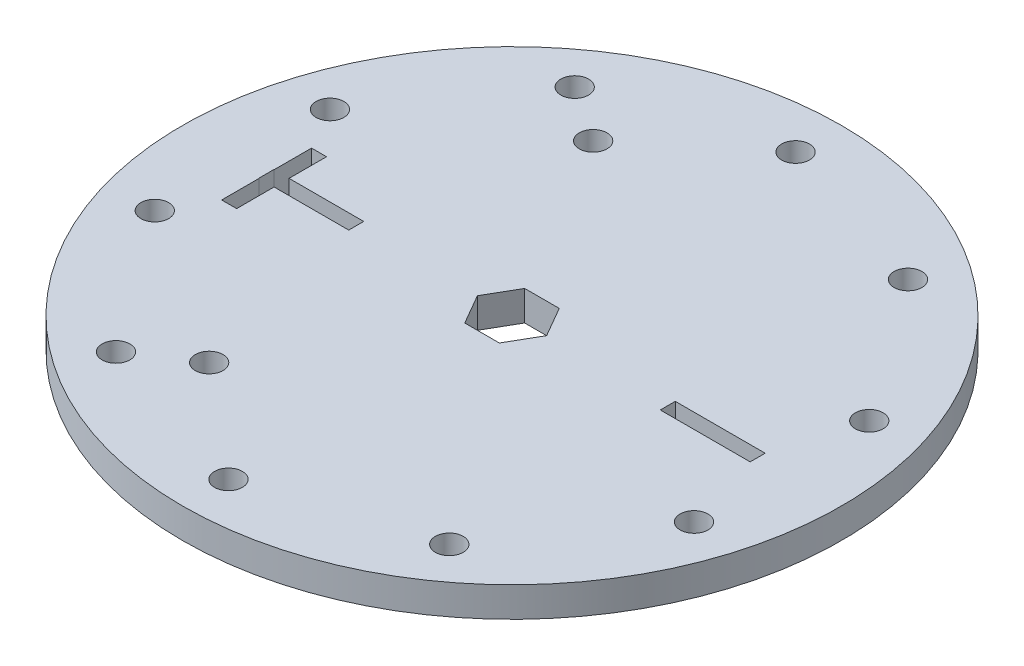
ISO-10303-21;
HEADER;
FILE_DESCRIPTION(('STEP AP214'),'2;1');
FILE_NAME('part.step','',(''),(''),'','','');
FILE_SCHEMA(('AUTOMOTIVE_DESIGN { 1 0 10303 214 1 1 1 1 }'));
ENDSEC;
DATA;
#1=APPLICATION_CONTEXT('core data for automotive mechanical design processes');
#2=APPLICATION_PROTOCOL_DEFINITION('international standard','automotive_design',2000,#1);
#3=PRODUCT_CONTEXT('',#1,'mechanical');
#4=PRODUCT('Part','Part','',(#3));
#5=PRODUCT_RELATED_PRODUCT_CATEGORY('part','',(#4));
#6=PRODUCT_DEFINITION_FORMATION('','',#4);
#7=PRODUCT_DEFINITION_CONTEXT('part definition',#1,'design');
#8=PRODUCT_DEFINITION('design','',#6,#7);
#9=PRODUCT_DEFINITION_SHAPE('','',#8);
#10=(LENGTH_UNIT() NAMED_UNIT(*) SI_UNIT(.MILLI.,.METRE.));
#11=(NAMED_UNIT(*) PLANE_ANGLE_UNIT() SI_UNIT($,.RADIAN.));
#12=(NAMED_UNIT(*) SI_UNIT($,.STERADIAN.) SOLID_ANGLE_UNIT());
#13=UNCERTAINTY_MEASURE_WITH_UNIT(LENGTH_MEASURE(1.E-05),#10,'distance_accuracy_value','');
#14=(GEOMETRIC_REPRESENTATION_CONTEXT(3) GLOBAL_UNCERTAINTY_ASSIGNED_CONTEXT((#13)) GLOBAL_UNIT_ASSIGNED_CONTEXT((#10,
#11,#12)) REPRESENTATION_CONTEXT('',''));
#15=CARTESIAN_POINT('',(0.,0.,0.));
#16=DIRECTION('',(0.,0.,1.));
#17=DIRECTION('',(1.,0.,0.));
#18=AXIS2_PLACEMENT_3D('',#15,#16,#17);
#19=CARTESIAN_POINT('',(-26.035,0.,-0.79375));
#20=DIRECTION('',(0.,0.,-1.));
#21=DIRECTION('',(-1.,0.,0.));
#22=AXIS2_PLACEMENT_3D('',#19,#20,#21);
#23=PLANE('',#22);
#24=DIRECTION('',(-1.,0.,0.));
#25=VECTOR('',#24,1.);
#26=CARTESIAN_POINT('',(-26.035,0.,-0.79375));
#27=LINE('',#26,#25);
#28=CARTESIAN_POINT('',(-26.0055980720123,0.,-0.79375));
#29=VERTEX_POINT('',#28);
#30=CARTESIAN_POINT('',(-26.035,0.,-0.79375));
#31=VERTEX_POINT('',#30);
#32=EDGE_CURVE('E276',#29,#31,#27,.T.);
#33=ORIENTED_EDGE('',*,*,#32,.F.);
#34=DIRECTION('',(0.,1.,0.));
#35=VECTOR('',#34,1.);
#36=CARTESIAN_POINT('',(-26.0055980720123,0.,-0.79375));
#37=LINE('',#36,#35);
#38=CARTESIAN_POINT('',(-26.0055980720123,3.175,-0.79375));
#39=VERTEX_POINT('',#38);
#40=EDGE_CURVE('E232',#29,#39,#37,.T.);
#41=ORIENTED_EDGE('',*,*,#40,.T.);
#42=DIRECTION('',(-1.,0.,0.));
#43=VECTOR('',#42,1.);
#44=CARTESIAN_POINT('',(-26.035,3.175,-0.79375));
#45=LINE('',#44,#43);
#46=CARTESIAN_POINT('',(-26.035,3.175,-0.79375));
#47=VERTEX_POINT('',#46);
#48=EDGE_CURVE('E289',#39,#47,#45,.T.);
#49=ORIENTED_EDGE('',*,*,#48,.T.);
#50=DIRECTION('',(0.,1.,0.));
#51=VECTOR('',#50,1.);
#52=CARTESIAN_POINT('',(-26.035,0.,-0.79375));
#53=LINE('',#52,#51);
#54=EDGE_CURVE('E292',#31,#47,#53,.T.);
#55=ORIENTED_EDGE('',*,*,#54,.F.);
#56=EDGE_LOOP('',(#33,#41,#49,#55));
#57=FACE_BOUND('',#56,.T.);
#58=ADVANCED_FACE('F33',(#57),#23,.F.);
#59=CARTESIAN_POINT('',(-26.035,0.,0.793750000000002));
#60=DIRECTION('',(0.,0.,1.));
#61=DIRECTION('',(1.,0.,0.));
#62=AXIS2_PLACEMENT_3D('',#59,#60,#61);
#63=PLANE('',#62);
#64=DIRECTION('',(1.,0.,0.));
#65=VECTOR('',#64,1.);
#66=CARTESIAN_POINT('',(-26.035,3.175,0.793750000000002));
#67=LINE('',#66,#65);
#68=CARTESIAN_POINT('',(-26.035,3.175,0.793750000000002));
#69=VERTEX_POINT('',#68);
#70=CARTESIAN_POINT('',(-26.0055980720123,3.175,0.793750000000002));
#71=VERTEX_POINT('',#70);
#72=EDGE_CURVE('E283',#69,#71,#67,.T.);
#73=ORIENTED_EDGE('',*,*,#72,.T.);
#74=DIRECTION('',(0.,-1.,0.));
#75=VECTOR('',#74,1.);
#76=CARTESIAN_POINT('',(-26.0055980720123,0.,0.793750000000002));
#77=LINE('',#76,#75);
#78=CARTESIAN_POINT('',(-26.0055980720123,0.,0.793750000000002));
#79=VERTEX_POINT('',#78);
#80=EDGE_CURVE('E11',#71,#79,#77,.T.);
#81=ORIENTED_EDGE('',*,*,#80,.T.);
#82=DIRECTION('',(1.,0.,0.));
#83=VECTOR('',#82,1.);
#84=CARTESIAN_POINT('',(-26.035,0.,0.793750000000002));
#85=LINE('',#84,#83);
#86=CARTESIAN_POINT('',(-26.035,0.,0.793750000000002));
#87=VERTEX_POINT('',#86);
#88=EDGE_CURVE('E208',#87,#79,#85,.T.);
#89=ORIENTED_EDGE('',*,*,#88,.F.);
#90=DIRECTION('',(0.,1.,0.));
#91=VECTOR('',#90,1.);
#92=CARTESIAN_POINT('',(-26.035,0.,0.793750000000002));
#93=LINE('',#92,#91);
#94=EDGE_CURVE('E280',#87,#69,#93,.T.);
#95=ORIENTED_EDGE('',*,*,#94,.T.);
#96=EDGE_LOOP('',(#73,#81,#89,#95));
#97=FACE_BOUND('',#96,.T.);
#98=ADVANCED_FACE('F444',(#97),#63,.F.);
#99=CARTESIAN_POINT('',(0.,3.175,0.));
#100=DIRECTION('',(0.,1.,0.));
#101=DIRECTION('',(0.,0.,1.));
#102=AXIS2_PLACEMENT_3D('',#99,#100,#101);
#103=PLANE('',#102);
#104=DIRECTION('',(0.,0.,1.));
#105=VECTOR('',#104,1.);
#106=CARTESIAN_POINT('',(-26.0055980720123,3.175,-4.7625));
#107=LINE('',#106,#105);
#108=CARTESIAN_POINT('',(-26.0055980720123,3.175,-4.7625));
#109=VERTEX_POINT('',#108);
#110=EDGE_CURVE('E218',#109,#39,#107,.T.);
#111=ORIENTED_EDGE('',*,*,#110,.F.);
#112=DIRECTION('',(-1.,0.,0.));
#113=VECTOR('',#112,1.);
#114=CARTESIAN_POINT('',(-26.0055980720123,3.175,-4.7625));
#115=LINE('',#114,#113);
#116=CARTESIAN_POINT('',(-24.4180980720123,3.175,-4.7625));
#117=VERTEX_POINT('',#116);
#118=EDGE_CURVE('E209',#117,#109,#115,.T.);
#119=ORIENTED_EDGE('',*,*,#118,.F.);
#120=DIRECTION('',(0.,0.,-1.));
#121=VECTOR('',#120,1.);
#122=CARTESIAN_POINT('',(-24.4180980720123,3.175,-4.7625));
#123=LINE('',#122,#121);
#124=CARTESIAN_POINT('',(-24.4180980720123,3.175,-0.79375));
#125=VERTEX_POINT('',#124);
#126=EDGE_CURVE('E222',#125,#117,#123,.T.);
#127=ORIENTED_EDGE('',*,*,#126,.F.);
#128=CARTESIAN_POINT('',(-16.51,3.175,-0.79375));
#129=VERTEX_POINT('',#128);
#130=EDGE_CURVE('E271',#129,#125,#45,.T.);
#131=ORIENTED_EDGE('',*,*,#130,.F.);
#132=DIRECTION('',(0.,0.,-1.));
#133=VECTOR('',#132,1.);
#134=CARTESIAN_POINT('',(-16.51,3.175,-0.79375));
#135=LINE('',#134,#133);
#136=CARTESIAN_POINT('',(-16.51,3.175,0.79375));
#137=VERTEX_POINT('',#136);
#138=EDGE_CURVE('E286',#137,#129,#135,.T.);
#139=ORIENTED_EDGE('',*,*,#138,.F.);
#140=CARTESIAN_POINT('',(-24.4180980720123,3.175,0.793750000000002));
#141=VERTEX_POINT('',#140);
#142=EDGE_CURVE('E282',#141,#137,#67,.T.);
#143=ORIENTED_EDGE('',*,*,#142,.F.);
#144=CARTESIAN_POINT('',(-24.4180980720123,3.175,4.7625));
#145=VERTEX_POINT('',#144);
#146=EDGE_CURVE('E56',#145,#141,#123,.T.);
#147=ORIENTED_EDGE('',*,*,#146,.F.);
#148=DIRECTION('',(1.,0.,0.));
#149=VECTOR('',#148,1.);
#150=CARTESIAN_POINT('',(-26.0055980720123,3.175,4.7625));
#151=LINE('',#150,#149);
#152=CARTESIAN_POINT('',(-26.0055980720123,3.175,4.7625));
#153=VERTEX_POINT('',#152);
#154=EDGE_CURVE('E220',#153,#145,#151,.T.);
#155=ORIENTED_EDGE('',*,*,#154,.F.);
#156=EDGE_CURVE('E187',#71,#153,#107,.T.);
#157=ORIENTED_EDGE('',*,*,#156,.F.);
#158=ORIENTED_EDGE('',*,*,#72,.F.);
#159=DIRECTION('',(0.,0.,1.));
#160=VECTOR('',#159,1.);
#161=CARTESIAN_POINT('',(-26.035,3.175,-0.79375));
#162=LINE('',#161,#160);
#163=EDGE_CURVE('E261',#47,#69,#162,.T.);
#164=ORIENTED_EDGE('',*,*,#163,.F.);
#165=ORIENTED_EDGE('',*,*,#48,.F.);
#166=EDGE_LOOP('',(#111,#119,#127,#131,#139,#143,#147,#155,#157,#158,#164,#165));
#167=FACE_BOUND('',#166,.T.);
#168=DIRECTION('',(-1.,0.,0.));
#169=VECTOR('',#168,1.);
#170=CARTESIAN_POINT('',(26.035,3.175,-0.793749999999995));
#171=LINE('',#170,#169);
#172=CARTESIAN_POINT('',(26.035,3.175,-0.793749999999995));
#173=VERTEX_POINT('',#172);
#174=CARTESIAN_POINT('',(16.51,3.175,-0.793749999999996));
#175=VERTEX_POINT('',#174);
#176=EDGE_CURVE('E235',#173,#175,#171,.T.);
#177=ORIENTED_EDGE('',*,*,#176,.F.);
#178=DIRECTION('',(0.,0.,-1.));
#179=VECTOR('',#178,1.);
#180=CARTESIAN_POINT('',(26.035,3.175,-0.793749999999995));
#181=LINE('',#180,#179);
#182=CARTESIAN_POINT('',(26.035,3.175,0.793749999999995));
#183=VERTEX_POINT('',#182);
#184=EDGE_CURVE('E240',#183,#173,#181,.T.);
#185=ORIENTED_EDGE('',*,*,#184,.F.);
#186=DIRECTION('',(1.,0.,0.));
#187=VECTOR('',#186,1.);
#188=CARTESIAN_POINT('',(26.035,3.175,0.793749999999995));
#189=LINE('',#188,#187);
#190=CARTESIAN_POINT('',(16.51,3.175,0.793749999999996));
#191=VERTEX_POINT('',#190);
#192=EDGE_CURVE('E254',#191,#183,#189,.T.);
#193=ORIENTED_EDGE('',*,*,#192,.F.);
#194=DIRECTION('',(0.,0.,1.));
#195=VECTOR('',#194,1.);
#196=CARTESIAN_POINT('',(16.51,3.175,-0.793749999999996));
#197=LINE('',#196,#195);
#198=EDGE_CURVE('E251',#175,#191,#197,.T.);
#199=ORIENTED_EDGE('',*,*,#198,.F.);
#200=EDGE_LOOP('',(#177,#185,#193,#199));
#201=FACE_BOUND('',#200,.T.);
#202=CARTESIAN_POINT('',(-11.7475,3.175,-20.3472668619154));
#203=DIRECTION('',(0.,1.,0.));
#204=DIRECTION('',(0.,0.,1.));
#205=AXIS2_PLACEMENT_3D('',#202,#203,#204);
#206=CIRCLE('',#205,1.47319999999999);
#207=CARTESIAN_POINT('',(-11.7475,3.175,-18.8740668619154));
#208=VERTEX_POINT('',#207);
#209=EDGE_CURVE('E295',#208,#208,#206,.T.);
#210=ORIENTED_EDGE('',*,*,#209,.F.);
#211=EDGE_LOOP('',(#210));
#212=FACE_BOUND('',#211,.T.);
#213=CARTESIAN_POINT('',(-11.7474999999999,3.175,20.3472668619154));
#214=DIRECTION('',(0.,1.,0.));
#215=DIRECTION('',(0.,0.,1.));
#216=AXIS2_PLACEMENT_3D('',#213,#214,#215);
#217=CIRCLE('',#216,1.47319999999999);
#218=CARTESIAN_POINT('',(-11.7474999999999,3.175,21.8204668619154));
#219=VERTEX_POINT('',#218);
#220=EDGE_CURVE('E308',#219,#219,#217,.T.);
#221=ORIENTED_EDGE('',*,*,#220,.F.);
#222=EDGE_LOOP('',(#221));
#223=FACE_BOUND('',#222,.T.);
#224=CARTESIAN_POINT('',(0.,3.175,-30.0455330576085));
#225=DIRECTION('',(0.,1.,0.));
#226=DIRECTION('',(0.,0.,1.));
#227=AXIS2_PLACEMENT_3D('',#224,#225,#226);
#228=CIRCLE('',#227,1.4732);
#229=CARTESIAN_POINT('',(0.,3.175,-28.5723330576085));
#230=VERTEX_POINT('',#229);
#231=EDGE_CURVE('E314',#230,#230,#228,.T.);
#232=ORIENTED_EDGE('',*,*,#231,.F.);
#233=EDGE_LOOP('',(#232));
#234=FACE_BOUND('',#233,.T.);
#235=CARTESIAN_POINT('',(-17.6603212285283,3.175,-24.3073468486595));
#236=DIRECTION('',(0.,1.,0.));
#237=DIRECTION('',(0.,0.,1.));
#238=AXIS2_PLACEMENT_3D('',#235,#236,#237);
#239=CIRCLE('',#238,1.4732);
#240=CARTESIAN_POINT('',(-17.6603212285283,3.175,-22.8341468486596));
#241=VERTEX_POINT('',#240);
#242=EDGE_CURVE('E320',#241,#241,#239,.T.);
#243=ORIENTED_EDGE('',*,*,#242,.F.);
#244=EDGE_LOOP('',(#243));
#245=FACE_BOUND('',#244,.T.);
#246=CARTESIAN_POINT('',(-28.575,3.175,-9.2845803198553));
#247=DIRECTION('',(0.,1.,0.));
#248=DIRECTION('',(0.,0.,1.));
#249=AXIS2_PLACEMENT_3D('',#246,#247,#248);
#250=CIRCLE('',#249,1.4732);
#251=CARTESIAN_POINT('',(-28.575,3.175,-7.8113803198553));
#252=VERTEX_POINT('',#251);
#253=EDGE_CURVE('E326',#252,#252,#250,.T.);
#254=ORIENTED_EDGE('',*,*,#253,.F.);
#255=EDGE_LOOP('',(#254));
#256=FACE_BOUND('',#255,.T.);
#257=CARTESIAN_POINT('',(-28.575,3.175,9.28458031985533));
#258=DIRECTION('',(0.,1.,0.));
#259=DIRECTION('',(0.,0.,1.));
#260=AXIS2_PLACEMENT_3D('',#257,#258,#259);
#261=CIRCLE('',#260,1.4732);
#262=CARTESIAN_POINT('',(-28.575,3.175,10.7577803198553));
#263=VERTEX_POINT('',#262);
#264=EDGE_CURVE('E332',#263,#263,#261,.T.);
#265=ORIENTED_EDGE('',*,*,#264,.F.);
#266=EDGE_LOOP('',(#265));
#267=FACE_BOUND('',#266,.T.);
#268=CARTESIAN_POINT('',(-17.6603212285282,3.175,24.3073468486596));
#269=DIRECTION('',(0.,1.,0.));
#270=DIRECTION('',(0.,0.,1.));
#271=AXIS2_PLACEMENT_3D('',#268,#269,#270);
#272=CIRCLE('',#271,1.4732);
#273=CARTESIAN_POINT('',(-17.6603212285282,3.175,25.7805468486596));
#274=VERTEX_POINT('',#273);
#275=EDGE_CURVE('E338',#274,#274,#272,.T.);
#276=ORIENTED_EDGE('',*,*,#275,.F.);
#277=EDGE_LOOP('',(#276));
#278=FACE_BOUND('',#277,.T.);
#279=CARTESIAN_POINT('',(0.,3.175,30.0455330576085));
#280=DIRECTION('',(0.,1.,0.));
#281=DIRECTION('',(0.,0.,1.));
#282=AXIS2_PLACEMENT_3D('',#279,#280,#281);
#283=CIRCLE('',#282,1.4732);
#284=CARTESIAN_POINT('',(0.,3.175,31.5187330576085));
#285=VERTEX_POINT('',#284);
#286=EDGE_CURVE('E344',#285,#285,#283,.T.);
#287=ORIENTED_EDGE('',*,*,#286,.F.);
#288=EDGE_LOOP('',(#287));
#289=FACE_BOUND('',#288,.T.);
#290=CARTESIAN_POINT('',(17.6603212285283,3.175,24.3073468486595));
#291=DIRECTION('',(0.,1.,0.));
#292=DIRECTION('',(0.,0.,1.));
#293=AXIS2_PLACEMENT_3D('',#290,#291,#292);
#294=CIRCLE('',#293,1.4732);
#295=CARTESIAN_POINT('',(17.6603212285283,3.175,25.7805468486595));
#296=VERTEX_POINT('',#295);
#297=EDGE_CURVE('E350',#296,#296,#294,.T.);
#298=ORIENTED_EDGE('',*,*,#297,.F.);
#299=EDGE_LOOP('',(#298));
#300=FACE_BOUND('',#299,.T.);
#301=CARTESIAN_POINT('',(28.575,3.175,9.28458031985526));
#302=DIRECTION('',(0.,1.,0.));
#303=DIRECTION('',(0.,0.,1.));
#304=AXIS2_PLACEMENT_3D('',#301,#302,#303);
#305=CIRCLE('',#304,1.4732);
#306=CARTESIAN_POINT('',(28.575,3.175,10.7577803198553));
#307=VERTEX_POINT('',#306);
#308=EDGE_CURVE('E356',#307,#307,#305,.T.);
#309=ORIENTED_EDGE('',*,*,#308,.F.);
#310=EDGE_LOOP('',(#309));
#311=FACE_BOUND('',#310,.T.);
#312=CARTESIAN_POINT('',(28.575,3.175,-9.28458031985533));
#313=DIRECTION('',(0.,1.,0.));
#314=DIRECTION('',(0.,0.,1.));
#315=AXIS2_PLACEMENT_3D('',#312,#313,#314);
#316=CIRCLE('',#315,1.4732);
#317=CARTESIAN_POINT('',(28.575,3.175,-7.81138031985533));
#318=VERTEX_POINT('',#317);
#319=EDGE_CURVE('E362',#318,#318,#316,.T.);
#320=ORIENTED_EDGE('',*,*,#319,.F.);
#321=EDGE_LOOP('',(#320));
#322=FACE_BOUND('',#321,.T.);
#323=CARTESIAN_POINT('',(17.6603212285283,3.175,-24.3073468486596));
#324=DIRECTION('',(0.,1.,0.));
#325=DIRECTION('',(0.,0.,1.));
#326=AXIS2_PLACEMENT_3D('',#323,#324,#325);
#327=CIRCLE('',#326,1.4732);
#328=CARTESIAN_POINT('',(17.6603212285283,3.175,-22.8341468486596));
#329=VERTEX_POINT('',#328);
#330=EDGE_CURVE('E368',#329,#329,#327,.T.);
#331=ORIENTED_EDGE('',*,*,#330,.F.);
#332=EDGE_LOOP('',(#331));
#333=FACE_BOUND('',#332,.T.);
#334=CARTESIAN_POINT('',(0.,3.175,0.));
#335=DIRECTION('',(0.,1.,0.));
#336=DIRECTION('',(0.,0.,1.));
#337=AXIS2_PLACEMENT_3D('',#334,#335,#336);
#338=CIRCLE('',#337,34.925);
#339=CARTESIAN_POINT('',(0.,3.175,34.925));
#340=VERTEX_POINT('',#339);
#341=EDGE_CURVE('E420',#340,#340,#338,.T.);
#342=ORIENTED_EDGE('',*,*,#341,.T.);
#343=EDGE_LOOP('',(#342));
#344=FACE_BOUND('',#343,.T.);
#345=DIRECTION('',(-1.,0.,0.));
#346=VECTOR('',#345,1.);
#347=CARTESIAN_POINT('',(1.83308710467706,3.175,-3.175));
#348=LINE('',#347,#346);
#349=CARTESIAN_POINT('',(1.83308710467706,3.175,-3.175));
#350=VERTEX_POINT('',#349);
#351=CARTESIAN_POINT('',(-1.83308710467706,3.175,-3.175));
#352=VERTEX_POINT('',#351);
#353=EDGE_CURVE('E377',#350,#352,#348,.T.);
#354=ORIENTED_EDGE('',*,*,#353,.F.);
#355=DIRECTION('',(-0.5,0.,-0.866025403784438));
#356=VECTOR('',#355,1.);
#357=CARTESIAN_POINT('',(3.66617420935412,3.175,0.));
#358=LINE('',#357,#356);
#359=CARTESIAN_POINT('',(3.66617420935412,3.175,0.));
#360=VERTEX_POINT('',#359);
#361=EDGE_CURVE('E375',#360,#350,#358,.T.);
#362=ORIENTED_EDGE('',*,*,#361,.F.);
#363=DIRECTION('',(0.5,0.,-0.866025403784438));
#364=VECTOR('',#363,1.);
#365=CARTESIAN_POINT('',(1.83308710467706,3.175,3.175));
#366=LINE('',#365,#364);
#367=CARTESIAN_POINT('',(1.83308710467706,3.175,3.175));
#368=VERTEX_POINT('',#367);
#369=EDGE_CURVE('E387',#368,#360,#366,.T.);
#370=ORIENTED_EDGE('',*,*,#369,.F.);
#371=DIRECTION('',(1.,0.,0.));
#372=VECTOR('',#371,1.);
#373=CARTESIAN_POINT('',(-1.83308710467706,3.175,3.175));
#374=LINE('',#373,#372);
#375=CARTESIAN_POINT('',(-1.83308710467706,3.175,3.175));
#376=VERTEX_POINT('',#375);
#377=EDGE_CURVE('E384',#376,#368,#374,.T.);
#378=ORIENTED_EDGE('',*,*,#377,.F.);
#379=DIRECTION('',(0.5,0.,0.866025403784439));
#380=VECTOR('',#379,1.);
#381=CARTESIAN_POINT('',(-3.66617420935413,3.175,0.));
#382=LINE('',#381,#380);
#383=CARTESIAN_POINT('',(-3.66617420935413,3.175,0.));
#384=VERTEX_POINT('',#383);
#385=EDGE_CURVE('E382',#384,#376,#382,.T.);
#386=ORIENTED_EDGE('',*,*,#385,.F.);
#387=DIRECTION('',(-0.5,0.,0.866025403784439));
#388=VECTOR('',#387,1.);
#389=CARTESIAN_POINT('',(-1.83308710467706,3.175,-3.175));
#390=LINE('',#389,#388);
#391=EDGE_CURVE('E380',#352,#384,#390,.T.);
#392=ORIENTED_EDGE('',*,*,#391,.F.);
#393=EDGE_LOOP('',(#354,#362,#370,#378,#386,#392));
#394=FACE_BOUND('',#393,.T.);
#395=ADVANCED_FACE('F432',(#167,#201,#212,#223,#234,#245,#256,#267,#278,#289,#300,#311,#322,
#333,#344,#394),#103,.T.);
#396=CARTESIAN_POINT('',(0.,0.,0.));
#397=DIRECTION('',(0.,1.,0.));
#398=DIRECTION('',(0.,0.,1.));
#399=AXIS2_PLACEMENT_3D('',#396,#397,#398);
#400=PLANE('',#399);
#401=DIRECTION('',(-1.,0.,0.));
#402=VECTOR('',#401,1.);
#403=CARTESIAN_POINT('',(-26.0055980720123,0.,-4.7625));
#404=LINE('',#403,#402);
#405=CARTESIAN_POINT('',(-24.4180980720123,0.,-4.7625));
#406=VERTEX_POINT('',#405);
#407=CARTESIAN_POINT('',(-26.0055980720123,0.,-4.7625));
#408=VERTEX_POINT('',#407);
#409=EDGE_CURVE('E192',#406,#408,#404,.T.);
#410=ORIENTED_EDGE('',*,*,#409,.T.);
#411=DIRECTION('',(0.,0.,1.));
#412=VECTOR('',#411,1.);
#413=CARTESIAN_POINT('',(-26.0055980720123,0.,-4.7625));
#414=LINE('',#413,#412);
#415=EDGE_CURVE('E200',#408,#29,#414,.T.);
#416=ORIENTED_EDGE('',*,*,#415,.T.);
#417=ORIENTED_EDGE('',*,*,#32,.T.);
#418=DIRECTION('',(0.,0.,1.));
#419=VECTOR('',#418,1.);
#420=CARTESIAN_POINT('',(-26.035,0.,-0.79375));
#421=LINE('',#420,#419);
#422=EDGE_CURVE('E268',#31,#87,#421,.T.);
#423=ORIENTED_EDGE('',*,*,#422,.T.);
#424=ORIENTED_EDGE('',*,*,#88,.T.);
#425=CARTESIAN_POINT('',(-26.0055980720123,0.,4.7625));
#426=VERTEX_POINT('',#425);
#427=EDGE_CURVE('E185',#79,#426,#414,.T.);
#428=ORIENTED_EDGE('',*,*,#427,.T.);
#429=DIRECTION('',(1.,0.,0.));
#430=VECTOR('',#429,1.);
#431=CARTESIAN_POINT('',(-26.0055980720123,0.,4.7625));
#432=LINE('',#431,#430);
#433=CARTESIAN_POINT('',(-24.4180980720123,0.,4.7625));
#434=VERTEX_POINT('',#433);
#435=EDGE_CURVE('E195',#426,#434,#432,.T.);
#436=ORIENTED_EDGE('',*,*,#435,.T.);
#437=DIRECTION('',(0.,0.,-1.));
#438=VECTOR('',#437,1.);
#439=CARTESIAN_POINT('',(-24.4180980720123,0.,-4.7625));
#440=LINE('',#439,#438);
#441=CARTESIAN_POINT('',(-24.4180980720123,0.,0.793750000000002));
#442=VERTEX_POINT('',#441);
#443=EDGE_CURVE('E215',#434,#442,#440,.T.);
#444=ORIENTED_EDGE('',*,*,#443,.T.);
#445=CARTESIAN_POINT('',(-16.51,0.,0.79375));
#446=VERTEX_POINT('',#445);
#447=EDGE_CURVE('E270',#442,#446,#85,.T.);
#448=ORIENTED_EDGE('',*,*,#447,.T.);
#449=DIRECTION('',(0.,0.,-1.));
#450=VECTOR('',#449,1.);
#451=CARTESIAN_POINT('',(-16.51,0.,-0.79375));
#452=LINE('',#451,#450);
#453=CARTESIAN_POINT('',(-16.51,0.,-0.79375));
#454=VERTEX_POINT('',#453);
#455=EDGE_CURVE('E273',#446,#454,#452,.T.);
#456=ORIENTED_EDGE('',*,*,#455,.T.);
#457=CARTESIAN_POINT('',(-24.4180980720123,0.,-0.79375));
#458=VERTEX_POINT('',#457);
#459=EDGE_CURVE('E277',#454,#458,#27,.T.);
#460=ORIENTED_EDGE('',*,*,#459,.T.);
#461=EDGE_CURVE('E48',#458,#406,#440,.T.);
#462=ORIENTED_EDGE('',*,*,#461,.T.);
#463=EDGE_LOOP('',(#410,#416,#417,#423,#424,#428,#436,#444,#448,#456,#460,#462));
#464=FACE_BOUND('',#463,.T.);
#465=DIRECTION('',(0.,0.,-1.));
#466=VECTOR('',#465,1.);
#467=CARTESIAN_POINT('',(26.035,0.,-0.793749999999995));
#468=LINE('',#467,#466);
#469=CARTESIAN_POINT('',(26.035,0.,0.793749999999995));
#470=VERTEX_POINT('',#469);
#471=CARTESIAN_POINT('',(26.035,0.,-0.793749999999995));
#472=VERTEX_POINT('',#471);
#473=EDGE_CURVE('E246',#470,#472,#468,.T.);
#474=ORIENTED_EDGE('',*,*,#473,.T.);
#475=DIRECTION('',(-1.,0.,0.));
#476=VECTOR('',#475,1.);
#477=CARTESIAN_POINT('',(26.035,0.,-0.793749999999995));
#478=LINE('',#477,#476);
#479=CARTESIAN_POINT('',(16.51,0.,-0.793749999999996));
#480=VERTEX_POINT('',#479);
#481=EDGE_CURVE('E236',#472,#480,#478,.T.);
#482=ORIENTED_EDGE('',*,*,#481,.T.);
#483=DIRECTION('',(0.,0.,1.));
#484=VECTOR('',#483,1.);
#485=CARTESIAN_POINT('',(16.51,0.,-0.793749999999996));
#486=LINE('',#485,#484);
#487=CARTESIAN_POINT('',(16.51,0.,0.793749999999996));
#488=VERTEX_POINT('',#487);
#489=EDGE_CURVE('E239',#480,#488,#486,.T.);
#490=ORIENTED_EDGE('',*,*,#489,.T.);
#491=DIRECTION('',(1.,0.,0.));
#492=VECTOR('',#491,1.);
#493=CARTESIAN_POINT('',(26.035,0.,0.793749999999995));
#494=LINE('',#493,#492);
#495=EDGE_CURVE('E243',#488,#470,#494,.T.);
#496=ORIENTED_EDGE('',*,*,#495,.T.);
#497=EDGE_LOOP('',(#474,#482,#490,#496));
#498=FACE_BOUND('',#497,.T.);
#499=CARTESIAN_POINT('',(-11.7475,0.,-20.3472668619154));
#500=DIRECTION('',(0.,1.,0.));
#501=DIRECTION('',(0.,0.,1.));
#502=AXIS2_PLACEMENT_3D('',#499,#500,#501);
#503=CIRCLE('',#502,1.4732);
#504=CARTESIAN_POINT('',(-11.7475,0.,-18.8740668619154));
#505=VERTEX_POINT('',#504);
#506=EDGE_CURVE('E305',#505,#505,#503,.T.);
#507=ORIENTED_EDGE('',*,*,#506,.T.);
#508=EDGE_LOOP('',(#507));
#509=FACE_BOUND('',#508,.T.);
#510=CARTESIAN_POINT('',(-11.7474999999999,0.,20.3472668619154));
#511=DIRECTION('',(0.,1.,0.));
#512=DIRECTION('',(0.,0.,1.));
#513=AXIS2_PLACEMENT_3D('',#510,#511,#512);
#514=CIRCLE('',#513,1.4732);
#515=CARTESIAN_POINT('',(-11.7474999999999,0.,21.8204668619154));
#516=VERTEX_POINT('',#515);
#517=EDGE_CURVE('E311',#516,#516,#514,.T.);
#518=ORIENTED_EDGE('',*,*,#517,.T.);
#519=EDGE_LOOP('',(#518));
#520=FACE_BOUND('',#519,.T.);
#521=CARTESIAN_POINT('',(0.,0.,-30.0455330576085));
#522=DIRECTION('',(0.,1.,0.));
#523=DIRECTION('',(0.,0.,1.));
#524=AXIS2_PLACEMENT_3D('',#521,#522,#523);
#525=CIRCLE('',#524,1.4732);
#526=CARTESIAN_POINT('',(0.,0.,-28.5723330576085));
#527=VERTEX_POINT('',#526);
#528=EDGE_CURVE('E317',#527,#527,#525,.T.);
#529=ORIENTED_EDGE('',*,*,#528,.T.);
#530=EDGE_LOOP('',(#529));
#531=FACE_BOUND('',#530,.T.);
#532=CARTESIAN_POINT('',(-17.6603212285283,0.,-24.3073468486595));
#533=DIRECTION('',(0.,1.,0.));
#534=DIRECTION('',(0.,0.,1.));
#535=AXIS2_PLACEMENT_3D('',#532,#533,#534);
#536=CIRCLE('',#535,1.4732);
#537=CARTESIAN_POINT('',(-17.6603212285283,0.,-22.8341468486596));
#538=VERTEX_POINT('',#537);
#539=EDGE_CURVE('E323',#538,#538,#536,.T.);
#540=ORIENTED_EDGE('',*,*,#539,.T.);
#541=EDGE_LOOP('',(#540));
#542=FACE_BOUND('',#541,.T.);
#543=CARTESIAN_POINT('',(-28.575,0.,-9.2845803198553));
#544=DIRECTION('',(0.,1.,0.));
#545=DIRECTION('',(0.,0.,1.));
#546=AXIS2_PLACEMENT_3D('',#543,#544,#545);
#547=CIRCLE('',#546,1.4732);
#548=CARTESIAN_POINT('',(-28.575,0.,-7.81138031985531));
#549=VERTEX_POINT('',#548);
#550=EDGE_CURVE('E329',#549,#549,#547,.T.);
#551=ORIENTED_EDGE('',*,*,#550,.T.);
#552=EDGE_LOOP('',(#551));
#553=FACE_BOUND('',#552,.T.);
#554=CARTESIAN_POINT('',(-28.575,0.,9.28458031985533));
#555=DIRECTION('',(0.,1.,0.));
#556=DIRECTION('',(0.,0.,1.));
#557=AXIS2_PLACEMENT_3D('',#554,#555,#556);
#558=CIRCLE('',#557,1.4732);
#559=CARTESIAN_POINT('',(-28.575,0.,10.7577803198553));
#560=VERTEX_POINT('',#559);
#561=EDGE_CURVE('E335',#560,#560,#558,.T.);
#562=ORIENTED_EDGE('',*,*,#561,.T.);
#563=EDGE_LOOP('',(#562));
#564=FACE_BOUND('',#563,.T.);
#565=CARTESIAN_POINT('',(-17.6603212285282,0.,24.3073468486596));
#566=DIRECTION('',(0.,1.,0.));
#567=DIRECTION('',(0.,0.,1.));
#568=AXIS2_PLACEMENT_3D('',#565,#566,#567);
#569=CIRCLE('',#568,1.4732);
#570=CARTESIAN_POINT('',(-17.6603212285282,0.,25.7805468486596));
#571=VERTEX_POINT('',#570);
#572=EDGE_CURVE('E341',#571,#571,#569,.T.);
#573=ORIENTED_EDGE('',*,*,#572,.T.);
#574=EDGE_LOOP('',(#573));
#575=FACE_BOUND('',#574,.T.);
#576=CARTESIAN_POINT('',(0.,0.,30.0455330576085));
#577=DIRECTION('',(0.,1.,0.));
#578=DIRECTION('',(0.,0.,1.));
#579=AXIS2_PLACEMENT_3D('',#576,#577,#578);
#580=CIRCLE('',#579,1.4732);
#581=CARTESIAN_POINT('',(0.,0.,31.5187330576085));
#582=VERTEX_POINT('',#581);
#583=EDGE_CURVE('E347',#582,#582,#580,.T.);
#584=ORIENTED_EDGE('',*,*,#583,.T.);
#585=EDGE_LOOP('',(#584));
#586=FACE_BOUND('',#585,.T.);
#587=CARTESIAN_POINT('',(17.6603212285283,0.,24.3073468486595));
#588=DIRECTION('',(0.,1.,0.));
#589=DIRECTION('',(0.,0.,1.));
#590=AXIS2_PLACEMENT_3D('',#587,#588,#589);
#591=CIRCLE('',#590,1.4732);
#592=CARTESIAN_POINT('',(17.6603212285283,0.,25.7805468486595));
#593=VERTEX_POINT('',#592);
#594=EDGE_CURVE('E353',#593,#593,#591,.T.);
#595=ORIENTED_EDGE('',*,*,#594,.T.);
#596=EDGE_LOOP('',(#595));
#597=FACE_BOUND('',#596,.T.);
#598=CARTESIAN_POINT('',(28.575,0.,9.28458031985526));
#599=DIRECTION('',(0.,1.,0.));
#600=DIRECTION('',(0.,0.,1.));
#601=AXIS2_PLACEMENT_3D('',#598,#599,#600);
#602=CIRCLE('',#601,1.4732);
#603=CARTESIAN_POINT('',(28.575,0.,10.7577803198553));
#604=VERTEX_POINT('',#603);
#605=EDGE_CURVE('E359',#604,#604,#602,.T.);
#606=ORIENTED_EDGE('',*,*,#605,.T.);
#607=EDGE_LOOP('',(#606));
#608=FACE_BOUND('',#607,.T.);
#609=CARTESIAN_POINT('',(28.575,0.,-9.28458031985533));
#610=DIRECTION('',(0.,1.,0.));
#611=DIRECTION('',(0.,0.,1.));
#612=AXIS2_PLACEMENT_3D('',#609,#610,#611);
#613=CIRCLE('',#612,1.4732);
#614=CARTESIAN_POINT('',(28.575,0.,-7.81138031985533));
#615=VERTEX_POINT('',#614);
#616=EDGE_CURVE('E365',#615,#615,#613,.T.);
#617=ORIENTED_EDGE('',*,*,#616,.T.);
#618=EDGE_LOOP('',(#617));
#619=FACE_BOUND('',#618,.T.);
#620=CARTESIAN_POINT('',(17.6603212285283,0.,-24.3073468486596));
#621=DIRECTION('',(0.,1.,0.));
#622=DIRECTION('',(0.,0.,1.));
#623=AXIS2_PLACEMENT_3D('',#620,#621,#622);
#624=CIRCLE('',#623,1.4732);
#625=CARTESIAN_POINT('',(17.6603212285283,0.,-22.8341468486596));
#626=VERTEX_POINT('',#625);
#627=EDGE_CURVE('E371',#626,#626,#624,.T.);
#628=ORIENTED_EDGE('',*,*,#627,.T.);
#629=EDGE_LOOP('',(#628));
#630=FACE_BOUND('',#629,.T.);
#631=CARTESIAN_POINT('',(0.,0.,0.));
#632=DIRECTION('',(0.,1.,0.));
#633=DIRECTION('',(0.,0.,1.));
#634=AXIS2_PLACEMENT_3D('',#631,#632,#633);
#635=CIRCLE('',#634,34.925);
#636=CARTESIAN_POINT('',(0.,0.,34.925));
#637=VERTEX_POINT('',#636);
#638=EDGE_CURVE('E419',#637,#637,#635,.T.);
#639=ORIENTED_EDGE('',*,*,#638,.F.);
#640=EDGE_LOOP('',(#639));
#641=FACE_BOUND('',#640,.T.);
#642=DIRECTION('',(-0.5,0.,-0.866025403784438));
#643=VECTOR('',#642,1.);
#644=CARTESIAN_POINT('',(3.66617420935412,0.,0.));
#645=LINE('',#644,#643);
#646=CARTESIAN_POINT('',(3.66617420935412,0.,0.));
#647=VERTEX_POINT('',#646);
#648=CARTESIAN_POINT('',(1.83308710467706,0.,-3.175));
#649=VERTEX_POINT('',#648);
#650=EDGE_CURVE('E374',#647,#649,#645,.T.);
#651=ORIENTED_EDGE('',*,*,#650,.T.);
#652=DIRECTION('',(-1.,0.,0.));
#653=VECTOR('',#652,1.);
#654=CARTESIAN_POINT('',(1.83308710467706,0.,-3.175));
#655=LINE('',#654,#653);
#656=CARTESIAN_POINT('',(-1.83308710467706,0.,-3.175));
#657=VERTEX_POINT('',#656);
#658=EDGE_CURVE('E392',#649,#657,#655,.T.);
#659=ORIENTED_EDGE('',*,*,#658,.T.);
#660=DIRECTION('',(-0.5,0.,0.866025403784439));
#661=VECTOR('',#660,1.);
#662=CARTESIAN_POINT('',(-1.83308710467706,0.,-3.175));
#663=LINE('',#662,#661);
#664=CARTESIAN_POINT('',(-3.66617420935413,0.,0.));
#665=VERTEX_POINT('',#664);
#666=EDGE_CURVE('E395',#657,#665,#663,.T.);
#667=ORIENTED_EDGE('',*,*,#666,.T.);
#668=DIRECTION('',(0.5,0.,0.866025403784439));
#669=VECTOR('',#668,1.);
#670=CARTESIAN_POINT('',(-3.66617420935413,0.,0.));
#671=LINE('',#670,#669);
#672=CARTESIAN_POINT('',(-1.83308710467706,0.,3.175));
#673=VERTEX_POINT('',#672);
#674=EDGE_CURVE('E398',#665,#673,#671,.T.);
#675=ORIENTED_EDGE('',*,*,#674,.T.);
#676=DIRECTION('',(1.,0.,0.));
#677=VECTOR('',#676,1.);
#678=CARTESIAN_POINT('',(-1.83308710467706,0.,3.175));
#679=LINE('',#678,#677);
#680=CARTESIAN_POINT('',(1.83308710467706,0.,3.175));
#681=VERTEX_POINT('',#680);
#682=EDGE_CURVE('E401',#673,#681,#679,.T.);
#683=ORIENTED_EDGE('',*,*,#682,.T.);
#684=DIRECTION('',(0.5,0.,-0.866025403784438));
#685=VECTOR('',#684,1.);
#686=CARTESIAN_POINT('',(1.83308710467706,0.,3.175));
#687=LINE('',#686,#685);
#688=EDGE_CURVE('E378',#681,#647,#687,.T.);
#689=ORIENTED_EDGE('',*,*,#688,.T.);
#690=EDGE_LOOP('',(#651,#659,#667,#675,#683,#689));
#691=FACE_BOUND('',#690,.T.);
#692=ADVANCED_FACE('F204',(#464,#498,#509,#520,#531,#542,#553,#564,#575,#586,#597,#608,#619,
#630,#641,#691),#400,.F.);
#693=CARTESIAN_POINT('',(0.,3.175,0.));
#694=DIRECTION('',(0.,-1.,0.));
#695=DIRECTION('',(0.,0.,-1.));
#696=AXIS2_PLACEMENT_3D('',#693,#694,#695);
#697=CYLINDRICAL_SURFACE('',#696,34.925);
#698=ORIENTED_EDGE('',*,*,#341,.F.);
#699=EDGE_LOOP('',(#698));
#700=FACE_BOUND('',#699,.T.);
#701=ORIENTED_EDGE('',*,*,#638,.T.);
#702=EDGE_LOOP('',(#701));
#703=FACE_BOUND('',#702,.T.);
#704=ADVANCED_FACE('F35',(#700,#703),#697,.T.);
#705=CARTESIAN_POINT('',(3.66617420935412,3.175,0.));
#706=DIRECTION('',(-0.866025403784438,0.,0.5));
#707=DIRECTION('',(0.500000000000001,0.,0.866025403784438));
#708=AXIS2_PLACEMENT_3D('',#705,#706,#707);
#709=PLANE('',#708);
#710=ORIENTED_EDGE('',*,*,#650,.F.);
#711=DIRECTION('',(0.,-1.,0.));
#712=VECTOR('',#711,1.);
#713=CARTESIAN_POINT('',(3.66617420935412,3.175,0.));
#714=LINE('',#713,#712);
#715=EDGE_CURVE('E389',#360,#647,#714,.T.);
#716=ORIENTED_EDGE('',*,*,#715,.F.);
#717=ORIENTED_EDGE('',*,*,#361,.T.);
#718=DIRECTION('',(0.,-1.,0.));
#719=VECTOR('',#718,1.);
#720=CARTESIAN_POINT('',(1.83308710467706,3.175,-3.175));
#721=LINE('',#720,#719);
#722=EDGE_CURVE('E416',#350,#649,#721,.T.);
#723=ORIENTED_EDGE('',*,*,#722,.T.);
#724=EDGE_LOOP('',(#710,#716,#717,#723));
#725=FACE_BOUND('',#724,.T.);
#726=ADVANCED_FACE('F557',(#725),#709,.T.);
#727=CARTESIAN_POINT('',(1.83308710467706,3.175,-3.175));
#728=DIRECTION('',(0.,0.,1.));
#729=DIRECTION('',(1.,0.,0.));
#730=AXIS2_PLACEMENT_3D('',#727,#728,#729);
#731=PLANE('',#730);
#732=ORIENTED_EDGE('',*,*,#658,.F.);
#733=ORIENTED_EDGE('',*,*,#722,.F.);
#734=ORIENTED_EDGE('',*,*,#353,.T.);
#735=DIRECTION('',(0.,-1.,0.));
#736=VECTOR('',#735,1.);
#737=CARTESIAN_POINT('',(-1.83308710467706,3.175,-3.175));
#738=LINE('',#737,#736);
#739=EDGE_CURVE('E414',#352,#657,#738,.T.);
#740=ORIENTED_EDGE('',*,*,#739,.T.);
#741=EDGE_LOOP('',(#732,#733,#734,#740));
#742=FACE_BOUND('',#741,.T.);
#743=ADVANCED_FACE('F553',(#742),#731,.T.);
#744=CARTESIAN_POINT('',(-1.83308710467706,3.175,-3.175));
#745=DIRECTION('',(0.866025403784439,0.,0.5));
#746=DIRECTION('',(0.5,0.,-0.866025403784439));
#747=AXIS2_PLACEMENT_3D('',#744,#745,#746);
#748=PLANE('',#747);
#749=ORIENTED_EDGE('',*,*,#666,.F.);
#750=ORIENTED_EDGE('',*,*,#739,.F.);
#751=ORIENTED_EDGE('',*,*,#391,.T.);
#752=DIRECTION('',(0.,-1.,0.));
#753=VECTOR('',#752,1.);
#754=CARTESIAN_POINT('',(-3.66617420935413,3.175,0.));
#755=LINE('',#754,#753);
#756=EDGE_CURVE('E412',#384,#665,#755,.T.);
#757=ORIENTED_EDGE('',*,*,#756,.T.);
#758=EDGE_LOOP('',(#749,#750,#751,#757));
#759=FACE_BOUND('',#758,.T.);
#760=ADVANCED_FACE('F549',(#759),#748,.T.);
#761=CARTESIAN_POINT('',(-3.66617420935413,3.175,0.));
#762=DIRECTION('',(0.866025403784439,0.,-0.5));
#763=DIRECTION('',(-0.5,0.,-0.866025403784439));
#764=AXIS2_PLACEMENT_3D('',#761,#762,#763);
#765=PLANE('',#764);
#766=ORIENTED_EDGE('',*,*,#674,.F.);
#767=ORIENTED_EDGE('',*,*,#756,.F.);
#768=ORIENTED_EDGE('',*,*,#385,.T.);
#769=DIRECTION('',(0.,-1.,0.));
#770=VECTOR('',#769,1.);
#771=CARTESIAN_POINT('',(-1.83308710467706,3.175,3.175));
#772=LINE('',#771,#770);
#773=EDGE_CURVE('E410',#376,#673,#772,.T.);
#774=ORIENTED_EDGE('',*,*,#773,.T.);
#775=EDGE_LOOP('',(#766,#767,#768,#774));
#776=FACE_BOUND('',#775,.T.);
#777=ADVANCED_FACE('F545',(#776),#765,.T.);
#778=CARTESIAN_POINT('',(-1.83308710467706,3.175,3.175));
#779=DIRECTION('',(0.,0.,-1.));
#780=DIRECTION('',(-1.,0.,0.));
#781=AXIS2_PLACEMENT_3D('',#778,#779,#780);
#782=PLANE('',#781);
#783=ORIENTED_EDGE('',*,*,#682,.F.);
#784=ORIENTED_EDGE('',*,*,#773,.F.);
#785=ORIENTED_EDGE('',*,*,#377,.T.);
#786=DIRECTION('',(0.,-1.,0.));
#787=VECTOR('',#786,1.);
#788=CARTESIAN_POINT('',(1.83308710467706,3.175,3.175));
#789=LINE('',#788,#787);
#790=EDGE_CURVE('E408',#368,#681,#789,.T.);
#791=ORIENTED_EDGE('',*,*,#790,.T.);
#792=EDGE_LOOP('',(#783,#784,#785,#791));
#793=FACE_BOUND('',#792,.T.);
#794=ADVANCED_FACE('F541',(#793),#782,.T.);
#795=CARTESIAN_POINT('',(1.83308710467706,3.175,3.175));
#796=DIRECTION('',(-0.866025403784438,0.,-0.5));
#797=DIRECTION('',(-0.5,0.,0.866025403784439));
#798=AXIS2_PLACEMENT_3D('',#795,#796,#797);
#799=PLANE('',#798);
#800=ORIENTED_EDGE('',*,*,#688,.F.);
#801=ORIENTED_EDGE('',*,*,#790,.F.);
#802=ORIENTED_EDGE('',*,*,#369,.T.);
#803=ORIENTED_EDGE('',*,*,#715,.T.);
#804=EDGE_LOOP('',(#800,#801,#802,#803));
#805=FACE_BOUND('',#804,.T.);
#806=ADVANCED_FACE('F537',(#805),#799,.T.);
#807=CARTESIAN_POINT('',(17.6603212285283,3.175,-24.3073468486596));
#808=DIRECTION('',(0.,1.,0.));
#809=DIRECTION('',(0.,0.,1.));
#810=AXIS2_PLACEMENT_3D('',#807,#808,#809);
#811=CYLINDRICAL_SURFACE('',#810,1.4732);
#812=ORIENTED_EDGE('',*,*,#627,.F.);
#813=EDGE_LOOP('',(#812));
#814=FACE_BOUND('',#813,.T.);
#815=ORIENTED_EDGE('',*,*,#330,.T.);
#816=EDGE_LOOP('',(#815));
#817=FACE_BOUND('',#816,.T.);
#818=ADVANCED_FACE('F533',(#814,#817),#811,.F.);
#819=CARTESIAN_POINT('',(28.575,3.175,-9.28458031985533));
#820=DIRECTION('',(0.,1.,0.));
#821=DIRECTION('',(0.,0.,1.));
#822=AXIS2_PLACEMENT_3D('',#819,#820,#821);
#823=CYLINDRICAL_SURFACE('',#822,1.4732);
#824=ORIENTED_EDGE('',*,*,#616,.F.);
#825=EDGE_LOOP('',(#824));
#826=FACE_BOUND('',#825,.T.);
#827=ORIENTED_EDGE('',*,*,#319,.T.);
#828=EDGE_LOOP('',(#827));
#829=FACE_BOUND('',#828,.T.);
#830=ADVANCED_FACE('F529',(#826,#829),#823,.F.);
#831=CARTESIAN_POINT('',(28.575,3.175,9.28458031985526));
#832=DIRECTION('',(0.,1.,0.));
#833=DIRECTION('',(0.,0.,1.));
#834=AXIS2_PLACEMENT_3D('',#831,#832,#833);
#835=CYLINDRICAL_SURFACE('',#834,1.4732);
#836=ORIENTED_EDGE('',*,*,#605,.F.);
#837=EDGE_LOOP('',(#836));
#838=FACE_BOUND('',#837,.T.);
#839=ORIENTED_EDGE('',*,*,#308,.T.);
#840=EDGE_LOOP('',(#839));
#841=FACE_BOUND('',#840,.T.);
#842=ADVANCED_FACE('F525',(#838,#841),#835,.F.);
#843=CARTESIAN_POINT('',(17.6603212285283,3.175,24.3073468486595));
#844=DIRECTION('',(0.,1.,0.));
#845=DIRECTION('',(0.,0.,1.));
#846=AXIS2_PLACEMENT_3D('',#843,#844,#845);
#847=CYLINDRICAL_SURFACE('',#846,1.4732);
#848=ORIENTED_EDGE('',*,*,#594,.F.);
#849=EDGE_LOOP('',(#848));
#850=FACE_BOUND('',#849,.T.);
#851=ORIENTED_EDGE('',*,*,#297,.T.);
#852=EDGE_LOOP('',(#851));
#853=FACE_BOUND('',#852,.T.);
#854=ADVANCED_FACE('F521',(#850,#853),#847,.F.);
#855=CARTESIAN_POINT('',(0.,3.175,30.0455330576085));
#856=DIRECTION('',(0.,1.,0.));
#857=DIRECTION('',(0.,0.,1.));
#858=AXIS2_PLACEMENT_3D('',#855,#856,#857);
#859=CYLINDRICAL_SURFACE('',#858,1.4732);
#860=ORIENTED_EDGE('',*,*,#583,.F.);
#861=EDGE_LOOP('',(#860));
#862=FACE_BOUND('',#861,.T.);
#863=ORIENTED_EDGE('',*,*,#286,.T.);
#864=EDGE_LOOP('',(#863));
#865=FACE_BOUND('',#864,.T.);
#866=ADVANCED_FACE('F517',(#862,#865),#859,.F.);
#867=CARTESIAN_POINT('',(-17.6603212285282,3.175,24.3073468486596));
#868=DIRECTION('',(0.,1.,0.));
#869=DIRECTION('',(0.,0.,1.));
#870=AXIS2_PLACEMENT_3D('',#867,#868,#869);
#871=CYLINDRICAL_SURFACE('',#870,1.4732);
#872=ORIENTED_EDGE('',*,*,#572,.F.);
#873=EDGE_LOOP('',(#872));
#874=FACE_BOUND('',#873,.T.);
#875=ORIENTED_EDGE('',*,*,#275,.T.);
#876=EDGE_LOOP('',(#875));
#877=FACE_BOUND('',#876,.T.);
#878=ADVANCED_FACE('F513',(#874,#877),#871,.F.);
#879=CARTESIAN_POINT('',(-28.575,3.175,9.28458031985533));
#880=DIRECTION('',(0.,1.,0.));
#881=DIRECTION('',(0.,0.,1.));
#882=AXIS2_PLACEMENT_3D('',#879,#880,#881);
#883=CYLINDRICAL_SURFACE('',#882,1.4732);
#884=ORIENTED_EDGE('',*,*,#561,.F.);
#885=EDGE_LOOP('',(#884));
#886=FACE_BOUND('',#885,.T.);
#887=ORIENTED_EDGE('',*,*,#264,.T.);
#888=EDGE_LOOP('',(#887));
#889=FACE_BOUND('',#888,.T.);
#890=ADVANCED_FACE('F509',(#886,#889),#883,.F.);
#891=CARTESIAN_POINT('',(-28.575,3.175,-9.2845803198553));
#892=DIRECTION('',(0.,1.,0.));
#893=DIRECTION('',(0.,0.,1.));
#894=AXIS2_PLACEMENT_3D('',#891,#892,#893);
#895=CYLINDRICAL_SURFACE('',#894,1.4732);
#896=ORIENTED_EDGE('',*,*,#550,.F.);
#897=EDGE_LOOP('',(#896));
#898=FACE_BOUND('',#897,.T.);
#899=ORIENTED_EDGE('',*,*,#253,.T.);
#900=EDGE_LOOP('',(#899));
#901=FACE_BOUND('',#900,.T.);
#902=ADVANCED_FACE('F505',(#898,#901),#895,.F.);
#903=CARTESIAN_POINT('',(-17.6603212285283,3.175,-24.3073468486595));
#904=DIRECTION('',(0.,1.,0.));
#905=DIRECTION('',(0.,0.,1.));
#906=AXIS2_PLACEMENT_3D('',#903,#904,#905);
#907=CYLINDRICAL_SURFACE('',#906,1.4732);
#908=ORIENTED_EDGE('',*,*,#539,.F.);
#909=EDGE_LOOP('',(#908));
#910=FACE_BOUND('',#909,.T.);
#911=ORIENTED_EDGE('',*,*,#242,.T.);
#912=EDGE_LOOP('',(#911));
#913=FACE_BOUND('',#912,.T.);
#914=ADVANCED_FACE('F501',(#910,#913),#907,.F.);
#915=CARTESIAN_POINT('',(0.,3.175,-30.0455330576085));
#916=DIRECTION('',(0.,1.,0.));
#917=DIRECTION('',(0.,0.,1.));
#918=AXIS2_PLACEMENT_3D('',#915,#916,#917);
#919=CYLINDRICAL_SURFACE('',#918,1.4732);
#920=ORIENTED_EDGE('',*,*,#528,.F.);
#921=EDGE_LOOP('',(#920));
#922=FACE_BOUND('',#921,.T.);
#923=ORIENTED_EDGE('',*,*,#231,.T.);
#924=EDGE_LOOP('',(#923));
#925=FACE_BOUND('',#924,.T.);
#926=ADVANCED_FACE('F497',(#922,#925),#919,.F.);
#927=CARTESIAN_POINT('',(-11.7474999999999,3.175,20.3472668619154));
#928=DIRECTION('',(0.,1.,0.));
#929=DIRECTION('',(0.,0.,1.));
#930=AXIS2_PLACEMENT_3D('',#927,#928,#929);
#931=CYLINDRICAL_SURFACE('',#930,1.47319999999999);
#932=ORIENTED_EDGE('',*,*,#517,.F.);
#933=EDGE_LOOP('',(#932));
#934=FACE_BOUND('',#933,.T.);
#935=ORIENTED_EDGE('',*,*,#220,.T.);
#936=EDGE_LOOP('',(#935));
#937=FACE_BOUND('',#936,.T.);
#938=ADVANCED_FACE('F491',(#934,#937),#931,.F.);
#939=CARTESIAN_POINT('',(-11.7475,3.175,-20.3472668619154));
#940=DIRECTION('',(0.,1.,0.));
#941=DIRECTION('',(0.,0.,1.));
#942=AXIS2_PLACEMENT_3D('',#939,#940,#941);
#943=CYLINDRICAL_SURFACE('',#942,1.47319999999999);
#944=ORIENTED_EDGE('',*,*,#506,.F.);
#945=EDGE_LOOP('',(#944));
#946=FACE_BOUND('',#945,.T.);
#947=ORIENTED_EDGE('',*,*,#209,.T.);
#948=EDGE_LOOP('',(#947));
#949=FACE_BOUND('',#948,.T.);
#950=ADVANCED_FACE('F486',(#946,#949),#943,.F.);
#951=CARTESIAN_POINT('',(-26.035,0.,-0.79375));
#952=DIRECTION('',(-1.,0.,0.));
#953=DIRECTION('',(0.,0.,1.));
#954=AXIS2_PLACEMENT_3D('',#951,#952,#953);
#955=PLANE('',#954);
#956=ORIENTED_EDGE('',*,*,#163,.T.);
#957=ORIENTED_EDGE('',*,*,#94,.F.);
#958=ORIENTED_EDGE('',*,*,#422,.F.);
#959=ORIENTED_EDGE('',*,*,#54,.T.);
#960=EDGE_LOOP('',(#956,#957,#958,#959));
#961=FACE_BOUND('',#960,.T.);
#962=ADVANCED_FACE('F447',(#961),#955,.F.);
#963=ORIENTED_EDGE('',*,*,#130,.T.);
#964=DIRECTION('',(0.,-1.,0.));
#965=VECTOR('',#964,1.);
#966=CARTESIAN_POINT('',(-24.4180980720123,0.,-0.79375));
#967=LINE('',#966,#965);
#968=EDGE_CURVE('E226',#125,#458,#967,.T.);
#969=ORIENTED_EDGE('',*,*,#968,.T.);
#970=ORIENTED_EDGE('',*,*,#459,.F.);
#971=DIRECTION('',(0.,1.,0.));
#972=VECTOR('',#971,1.);
#973=CARTESIAN_POINT('',(-16.51,0.,-0.79375));
#974=LINE('',#973,#972);
#975=EDGE_CURVE('E296',#454,#129,#974,.T.);
#976=ORIENTED_EDGE('',*,*,#975,.T.);
#977=EDGE_LOOP('',(#963,#969,#970,#976));
#978=FACE_BOUND('',#977,.T.);
#979=ADVANCED_FACE('F460',(#978),#23,.F.);
#980=CARTESIAN_POINT('',(-16.51,0.,-0.79375));
#981=DIRECTION('',(1.,0.,0.));
#982=DIRECTION('',(0.,0.,-1.));
#983=AXIS2_PLACEMENT_3D('',#980,#981,#982);
#984=PLANE('',#983);
#985=ORIENTED_EDGE('',*,*,#138,.T.);
#986=ORIENTED_EDGE('',*,*,#975,.F.);
#987=ORIENTED_EDGE('',*,*,#455,.F.);
#988=DIRECTION('',(0.,1.,0.));
#989=VECTOR('',#988,1.);
#990=CARTESIAN_POINT('',(-16.51,0.,0.79375));
#991=LINE('',#990,#989);
#992=EDGE_CURVE('E298',#446,#137,#991,.T.);
#993=ORIENTED_EDGE('',*,*,#992,.T.);
#994=EDGE_LOOP('',(#985,#986,#987,#993));
#995=FACE_BOUND('',#994,.T.);
#996=ADVANCED_FACE('F437',(#995),#984,.F.);
#997=ORIENTED_EDGE('',*,*,#447,.F.);
#998=DIRECTION('',(0.,1.,0.));
#999=VECTOR('',#998,1.);
#1000=CARTESIAN_POINT('',(-24.4180980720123,0.,0.793750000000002));
#1001=LINE('',#1000,#999);
#1002=EDGE_CURVE('E41',#442,#141,#1001,.T.);
#1003=ORIENTED_EDGE('',*,*,#1002,.T.);
#1004=ORIENTED_EDGE('',*,*,#142,.T.);
#1005=ORIENTED_EDGE('',*,*,#992,.F.);
#1006=EDGE_LOOP('',(#997,#1003,#1004,#1005));
#1007=FACE_BOUND('',#1006,.T.);
#1008=ADVANCED_FACE('F427',(#1007),#63,.F.);
#1009=CARTESIAN_POINT('',(26.035,0.,-0.793749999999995));
#1010=DIRECTION('',(0.,0.,-1.));
#1011=DIRECTION('',(-1.,0.,0.));
#1012=AXIS2_PLACEMENT_3D('',#1009,#1010,#1011);
#1013=PLANE('',#1012);
#1014=ORIENTED_EDGE('',*,*,#176,.T.);
#1015=DIRECTION('',(0.,1.,0.));
#1016=VECTOR('',#1015,1.);
#1017=CARTESIAN_POINT('',(16.51,0.,-0.793749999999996));
#1018=LINE('',#1017,#1016);
#1019=EDGE_CURVE('E249',#480,#175,#1018,.T.);
#1020=ORIENTED_EDGE('',*,*,#1019,.F.);
#1021=ORIENTED_EDGE('',*,*,#481,.F.);
#1022=DIRECTION('',(0.,1.,0.));
#1023=VECTOR('',#1022,1.);
#1024=CARTESIAN_POINT('',(26.035,0.,-0.793749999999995));
#1025=LINE('',#1024,#1023);
#1026=EDGE_CURVE('E259',#472,#173,#1025,.T.);
#1027=ORIENTED_EDGE('',*,*,#1026,.T.);
#1028=EDGE_LOOP('',(#1014,#1020,#1021,#1027));
#1029=FACE_BOUND('',#1028,.T.);
#1030=ADVANCED_FACE('F682',(#1029),#1013,.F.);
#1031=CARTESIAN_POINT('',(26.035,0.,-0.793749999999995));
#1032=DIRECTION('',(1.,0.,0.));
#1033=DIRECTION('',(0.,0.,-1.));
#1034=AXIS2_PLACEMENT_3D('',#1031,#1032,#1033);
#1035=PLANE('',#1034);
#1036=ORIENTED_EDGE('',*,*,#184,.T.);
#1037=ORIENTED_EDGE('',*,*,#1026,.F.);
#1038=ORIENTED_EDGE('',*,*,#473,.F.);
#1039=DIRECTION('',(0.,1.,0.));
#1040=VECTOR('',#1039,1.);
#1041=CARTESIAN_POINT('',(26.035,0.,0.793749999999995));
#1042=LINE('',#1041,#1040);
#1043=EDGE_CURVE('E262',#470,#183,#1042,.T.);
#1044=ORIENTED_EDGE('',*,*,#1043,.T.);
#1045=EDGE_LOOP('',(#1036,#1037,#1038,#1044));
#1046=FACE_BOUND('',#1045,.T.);
#1047=ADVANCED_FACE('F687',(#1046),#1035,.F.);
#1048=CARTESIAN_POINT('',(26.035,0.,0.793749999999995));
#1049=DIRECTION('',(0.,0.,1.));
#1050=DIRECTION('',(1.,0.,0.));
#1051=AXIS2_PLACEMENT_3D('',#1048,#1049,#1050);
#1052=PLANE('',#1051);
#1053=ORIENTED_EDGE('',*,*,#192,.T.);
#1054=ORIENTED_EDGE('',*,*,#1043,.F.);
#1055=ORIENTED_EDGE('',*,*,#495,.F.);
#1056=DIRECTION('',(0.,1.,0.));
#1057=VECTOR('',#1056,1.);
#1058=CARTESIAN_POINT('',(16.51,0.,0.793749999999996));
#1059=LINE('',#1058,#1057);
#1060=EDGE_CURVE('E264',#488,#191,#1059,.T.);
#1061=ORIENTED_EDGE('',*,*,#1060,.T.);
#1062=EDGE_LOOP('',(#1053,#1054,#1055,#1061));
#1063=FACE_BOUND('',#1062,.T.);
#1064=ADVANCED_FACE('F696',(#1063),#1052,.F.);
#1065=CARTESIAN_POINT('',(16.51,0.,-0.793749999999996));
#1066=DIRECTION('',(-1.,0.,0.));
#1067=DIRECTION('',(0.,0.,1.));
#1068=AXIS2_PLACEMENT_3D('',#1065,#1066,#1067);
#1069=PLANE('',#1068);
#1070=ORIENTED_EDGE('',*,*,#198,.T.);
#1071=ORIENTED_EDGE('',*,*,#1060,.F.);
#1072=ORIENTED_EDGE('',*,*,#489,.F.);
#1073=ORIENTED_EDGE('',*,*,#1019,.T.);
#1074=EDGE_LOOP('',(#1070,#1071,#1072,#1073));
#1075=FACE_BOUND('',#1074,.T.);
#1076=ADVANCED_FACE('F472',(#1075),#1069,.F.);
#1077=CARTESIAN_POINT('',(-24.4180980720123,0.,-4.7625));
#1078=DIRECTION('',(1.,0.,0.));
#1079=DIRECTION('',(0.,0.,-1.));
#1080=AXIS2_PLACEMENT_3D('',#1077,#1078,#1079);
#1081=PLANE('',#1080);
#1082=ORIENTED_EDGE('',*,*,#443,.F.);
#1083=DIRECTION('',(0.,1.,0.));
#1084=VECTOR('',#1083,1.);
#1085=CARTESIAN_POINT('',(-24.4180980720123,0.,4.7625));
#1086=LINE('',#1085,#1084);
#1087=EDGE_CURVE('E191',#434,#145,#1086,.T.);
#1088=ORIENTED_EDGE('',*,*,#1087,.T.);
#1089=ORIENTED_EDGE('',*,*,#146,.T.);
#1090=ORIENTED_EDGE('',*,*,#1002,.F.);
#1091=EDGE_LOOP('',(#1082,#1088,#1089,#1090));
#1092=FACE_BOUND('',#1091,.T.);
#1093=ADVANCED_FACE('F440',(#1092),#1081,.F.);
#1094=CARTESIAN_POINT('',(-26.0055980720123,0.,-4.7625));
#1095=DIRECTION('',(-1.,0.,0.));
#1096=DIRECTION('',(0.,0.,1.));
#1097=AXIS2_PLACEMENT_3D('',#1094,#1095,#1096);
#1098=PLANE('',#1097);
#1099=ORIENTED_EDGE('',*,*,#156,.T.);
#1100=DIRECTION('',(0.,1.,0.));
#1101=VECTOR('',#1100,1.);
#1102=CARTESIAN_POINT('',(-26.0055980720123,0.,4.7625));
#1103=LINE('',#1102,#1101);
#1104=EDGE_CURVE('E181',#426,#153,#1103,.T.);
#1105=ORIENTED_EDGE('',*,*,#1104,.F.);
#1106=ORIENTED_EDGE('',*,*,#427,.F.);
#1107=ORIENTED_EDGE('',*,*,#80,.F.);
#1108=EDGE_LOOP('',(#1099,#1105,#1106,#1107));
#1109=FACE_BOUND('',#1108,.T.);
#1110=ADVANCED_FACE('F183',(#1109),#1098,.F.);
#1111=CARTESIAN_POINT('',(-26.0055980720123,0.,4.7625));
#1112=DIRECTION('',(0.,0.,1.));
#1113=DIRECTION('',(1.,0.,0.));
#1114=AXIS2_PLACEMENT_3D('',#1111,#1112,#1113);
#1115=PLANE('',#1114);
#1116=ORIENTED_EDGE('',*,*,#154,.T.);
#1117=ORIENTED_EDGE('',*,*,#1087,.F.);
#1118=ORIENTED_EDGE('',*,*,#435,.F.);
#1119=ORIENTED_EDGE('',*,*,#1104,.T.);
#1120=EDGE_LOOP('',(#1116,#1117,#1118,#1119));
#1121=FACE_BOUND('',#1120,.T.);
#1122=ADVANCED_FACE('F196',(#1121),#1115,.F.);
#1123=ORIENTED_EDGE('',*,*,#415,.F.);
#1124=DIRECTION('',(0.,1.,0.));
#1125=VECTOR('',#1124,1.);
#1126=CARTESIAN_POINT('',(-26.0055980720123,0.,-4.7625));
#1127=LINE('',#1126,#1125);
#1128=EDGE_CURVE('E224',#408,#109,#1127,.T.);
#1129=ORIENTED_EDGE('',*,*,#1128,.T.);
#1130=ORIENTED_EDGE('',*,*,#110,.T.);
#1131=ORIENTED_EDGE('',*,*,#40,.F.);
#1132=EDGE_LOOP('',(#1123,#1129,#1130,#1131));
#1133=FACE_BOUND('',#1132,.T.);
#1134=ADVANCED_FACE('F455',(#1133),#1098,.F.);
#1135=ORIENTED_EDGE('',*,*,#126,.T.);
#1136=DIRECTION('',(0.,1.,0.));
#1137=VECTOR('',#1136,1.);
#1138=CARTESIAN_POINT('',(-24.4180980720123,0.,-4.7625));
#1139=LINE('',#1138,#1137);
#1140=EDGE_CURVE('E227',#406,#117,#1139,.T.);
#1141=ORIENTED_EDGE('',*,*,#1140,.F.);
#1142=ORIENTED_EDGE('',*,*,#461,.F.);
#1143=ORIENTED_EDGE('',*,*,#968,.F.);
#1144=EDGE_LOOP('',(#1135,#1141,#1142,#1143));
#1145=FACE_BOUND('',#1144,.T.);
#1146=ADVANCED_FACE('F461',(#1145),#1081,.F.);
#1147=CARTESIAN_POINT('',(-26.0055980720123,0.,-4.7625));
#1148=DIRECTION('',(0.,0.,-1.));
#1149=DIRECTION('',(-1.,0.,0.));
#1150=AXIS2_PLACEMENT_3D('',#1147,#1148,#1149);
#1151=PLANE('',#1150);
#1152=ORIENTED_EDGE('',*,*,#118,.T.);
#1153=ORIENTED_EDGE('',*,*,#1128,.F.);
#1154=ORIENTED_EDGE('',*,*,#409,.F.);
#1155=ORIENTED_EDGE('',*,*,#1140,.T.);
#1156=EDGE_LOOP('',(#1152,#1153,#1154,#1155));
#1157=FACE_BOUND('',#1156,.T.);
#1158=ADVANCED_FACE('F458',(#1157),#1151,.F.);
#1159=CLOSED_SHELL('',(#58,#98,#395,#692,#704,#726,#743,#760,#777,#794,#806,#818,#830,#842,#854,
#866,#878,#890,#902,#914,#926,#938,#950,#962,#979,#996,#1008,#1030,#1047,#1064,#1076,#1093,
#1110,#1122,#1134,#1146,#1158));
#1160=MANIFOLD_SOLID_BREP('B2',#1159);
#1161=ADVANCED_BREP_SHAPE_REPRESENTATION('',(#18,#1160),#14);
#1162=SHAPE_DEFINITION_REPRESENTATION(#9,#1161);
ENDSEC;
END-ISO-10303-21;
